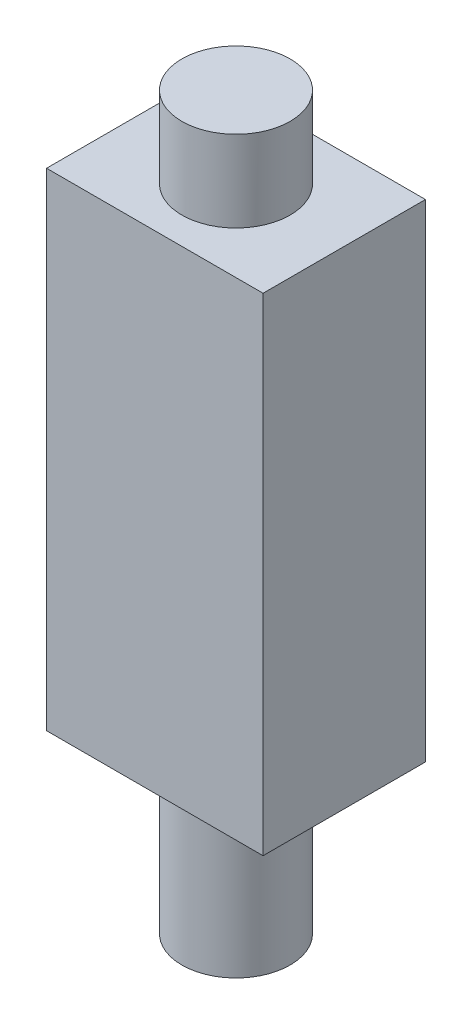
from build123d import *

# Parameters (mm, degrees)
SKETCH1_R           = 1
BOSS_EXTRUDE1_DEPTH = 3
SKETCH2_W           = 4
SKETCH2_H           = 3
BOSS_EXTRUDE2_DEPTH = 9
SKETCH3_R           = 1
BOSS_EXTRUDE3_DEPTH = 1.5


with BuildPart() as part:
    # Sketch1 → Boss-Extrude1 (new body)
    with BuildSketch(Plane(origin=(0, 0, 0), x_dir=(1, 0, 0), z_dir=(0, 1, 0))):
        with Locations(Location((0, 0, 0), (0, 0, 270))):
            Circle(SKETCH1_R)
    extrude(amount=BOSS_EXTRUDE1_DEPTH)

    # Sketch2 → Boss-Extrude2 (add)
    with BuildSketch(Plane(origin=(0, 3, 0), x_dir=(1, 0, 0), z_dir=(0, 1, 0))):
        Rectangle(SKETCH2_W, SKETCH2_H)
    extrude(amount=BOSS_EXTRUDE2_DEPTH)

    # Sketch3 → Boss-Extrude3 (add)
    with BuildSketch(Plane(origin=(0, 12, 0), x_dir=(1, 0, 0), z_dir=(0, 1, 0))):
        with Locations(Location((0, 0, 0), (0, 0, 270))):
            Circle(SKETCH3_R)
    extrude(amount=BOSS_EXTRUDE3_DEPTH)


solid = part.part
